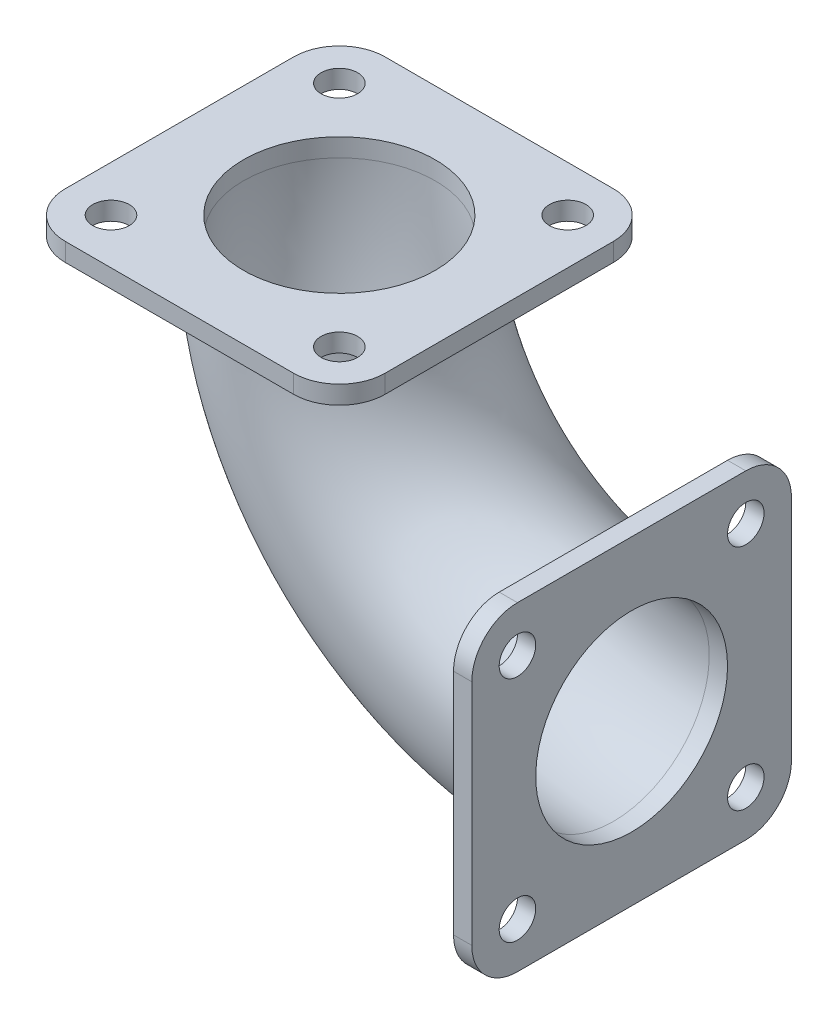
ISO-10303-21;
HEADER;
FILE_DESCRIPTION(('STEP AP214'),'2;1');
FILE_NAME('part.step','',(''),(''),'','','');
FILE_SCHEMA(('AUTOMOTIVE_DESIGN { 1 0 10303 214 1 1 1 1 }'));
ENDSEC;
DATA;
#1=APPLICATION_CONTEXT('core data for automotive mechanical design processes');
#2=APPLICATION_PROTOCOL_DEFINITION('international standard','automotive_design',2000,#1);
#3=PRODUCT_CONTEXT('',#1,'mechanical');
#4=PRODUCT('Part','Part','',(#3));
#5=PRODUCT_RELATED_PRODUCT_CATEGORY('part','',(#4));
#6=PRODUCT_DEFINITION_FORMATION('','',#4);
#7=PRODUCT_DEFINITION_CONTEXT('part definition',#1,'design');
#8=PRODUCT_DEFINITION('design','',#6,#7);
#9=PRODUCT_DEFINITION_SHAPE('','',#8);
#10=(LENGTH_UNIT() NAMED_UNIT(*) SI_UNIT(.MILLI.,.METRE.));
#11=(NAMED_UNIT(*) PLANE_ANGLE_UNIT() SI_UNIT($,.RADIAN.));
#12=(NAMED_UNIT(*) SI_UNIT($,.STERADIAN.) SOLID_ANGLE_UNIT());
#13=UNCERTAINTY_MEASURE_WITH_UNIT(LENGTH_MEASURE(1.E-05),#10,'distance_accuracy_value','');
#14=(GEOMETRIC_REPRESENTATION_CONTEXT(3) GLOBAL_UNCERTAINTY_ASSIGNED_CONTEXT((#13)) GLOBAL_UNIT_ASSIGNED_CONTEXT((#10,
#11,#12)) REPRESENTATION_CONTEXT('',''));
#15=CARTESIAN_POINT('',(0.,0.,0.));
#16=DIRECTION('',(0.,0.,1.));
#17=DIRECTION('',(1.,0.,0.));
#18=AXIS2_PLACEMENT_3D('',#15,#16,#17);
#19=CARTESIAN_POINT('',(0.,30.,0.));
#20=DIRECTION('',(0.,0.,1.));
#21=DIRECTION('',(1.,0.,0.));
#22=AXIS2_PLACEMENT_3D('',#19,#20,#21);
#23=TOROIDAL_SURFACE('',#22,30.,10.5);
#24=CARTESIAN_POINT('',(-30.,30.0000000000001,0.));
#25=DIRECTION('',(0.,-1.,0.));
#26=DIRECTION('',(0.,0.,-1.));
#27=AXIS2_PLACEMENT_3D('',#24,#25,#26);
#28=CIRCLE('',#27,10.5);
#29=CARTESIAN_POINT('',(-40.5,30.0000000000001,0.));
#30=VERTEX_POINT('',#29);
#31=EDGE_CURVE('E11',#30,#30,#28,.T.);
#32=CARTESIAN_POINT('',(0.,0.,0.));
#33=DIRECTION('',(1.,0.,0.));
#34=DIRECTION('',(0.,0.,-1.));
#35=AXIS2_PLACEMENT_3D('',#32,#33,#34);
#36=CIRCLE('',#35,10.5);
#37=CARTESIAN_POINT('',(0.,-10.5,0.));
#38=VERTEX_POINT('',#37);
#39=EDGE_CURVE('E282',#38,#38,#36,.T.);
#40=CARTESIAN_POINT('',(0.,30.,0.));
#41=DIRECTION('',(0.,0.,1.));
#42=DIRECTION('',(1.,0.,0.));
#43=AXIS2_PLACEMENT_3D('',#40,#41,#42);
#44=CIRCLE('',#43,40.5);
#45=EDGE_CURVE('',#30,#38,#44,.T.);
#46=ORIENTED_EDGE('',*,*,#31,.F.);
#47=ORIENTED_EDGE('',*,*,#39,.T.);
#48=ORIENTED_EDGE('',*,*,#45,.T.);
#49=ORIENTED_EDGE('',*,*,#45,.F.);
#50=EDGE_LOOP('',(#46,#48,#47,#49));
#51=FACE_BOUND('',#50,.T.);
#52=ADVANCED_FACE('F33',(#51),#23,.F.);
#53=CARTESIAN_POINT('',(0.,30.,0.));
#54=DIRECTION('',(0.,0.,1.));
#55=DIRECTION('',(1.,0.,0.));
#56=AXIS2_PLACEMENT_3D('',#53,#54,#55);
#57=TOROIDAL_SURFACE('',#56,30.,12.5);
#58=CARTESIAN_POINT('',(-30.,30.0000000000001,0.));
#59=DIRECTION('',(0.,1.,0.));
#60=DIRECTION('',(-1.,0.,0.));
#61=AXIS2_PLACEMENT_3D('',#58,#59,#60);
#62=CIRCLE('',#61,12.5);
#63=CARTESIAN_POINT('',(-42.5,30.0000000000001,0.));
#64=VERTEX_POINT('',#63);
#65=EDGE_CURVE('E165',#64,#64,#62,.F.);
#66=CARTESIAN_POINT('',(0.,0.,0.));
#67=DIRECTION('',(1.,0.,0.));
#68=DIRECTION('',(0.,0.,-1.));
#69=AXIS2_PLACEMENT_3D('',#66,#67,#68);
#70=CIRCLE('',#69,12.5);
#71=CARTESIAN_POINT('',(0.,-12.5,0.));
#72=VERTEX_POINT('',#71);
#73=EDGE_CURVE('E41',#72,#72,#70,.T.);
#74=CARTESIAN_POINT('',(0.,30.,0.));
#75=DIRECTION('',(0.,0.,1.));
#76=DIRECTION('',(1.,0.,0.));
#77=AXIS2_PLACEMENT_3D('',#74,#75,#76);
#78=CIRCLE('',#77,42.5);
#79=EDGE_CURVE('',#64,#72,#78,.T.);
#80=ORIENTED_EDGE('',*,*,#65,.T.);
#81=ORIENTED_EDGE('',*,*,#73,.F.);
#82=ORIENTED_EDGE('',*,*,#79,.T.);
#83=ORIENTED_EDGE('',*,*,#79,.F.);
#84=EDGE_LOOP('',(#80,#82,#81,#83));
#85=FACE_BOUND('',#84,.T.);
#86=ADVANCED_FACE('F35',(#85),#57,.T.);
#87=CARTESIAN_POINT('',(2.,12.5,12.5));
#88=DIRECTION('',(1.,0.,0.));
#89=DIRECTION('',(0.,0.,-1.));
#90=AXIS2_PLACEMENT_3D('',#87,#88,#89);
#91=PLANE('',#90);
#92=CARTESIAN_POINT('',(2.,12.5,-12.5));
#93=DIRECTION('',(1.,0.,0.));
#94=DIRECTION('',(0.,0.,-1.));
#95=AXIS2_PLACEMENT_3D('',#92,#93,#94);
#96=CIRCLE('',#95,2.);
#97=CARTESIAN_POINT('',(2.,12.5,-14.5));
#98=VERTEX_POINT('',#97);
#99=EDGE_CURVE('E567',#98,#98,#96,.T.);
#100=ORIENTED_EDGE('',*,*,#99,.F.);
#101=EDGE_LOOP('',(#100));
#102=FACE_BOUND('',#101,.T.);
#103=CARTESIAN_POINT('',(2.,-12.5,-12.5));
#104=DIRECTION('',(1.,0.,0.));
#105=DIRECTION('',(0.,0.,-1.));
#106=AXIS2_PLACEMENT_3D('',#103,#104,#105);
#107=CIRCLE('',#106,2.);
#108=CARTESIAN_POINT('',(2.,-12.5,-14.5));
#109=VERTEX_POINT('',#108);
#110=EDGE_CURVE('E573',#109,#109,#107,.T.);
#111=ORIENTED_EDGE('',*,*,#110,.F.);
#112=EDGE_LOOP('',(#111));
#113=FACE_BOUND('',#112,.T.);
#114=CARTESIAN_POINT('',(2.,12.5,12.5));
#115=DIRECTION('',(1.,0.,0.));
#116=DIRECTION('',(0.,0.,-1.));
#117=AXIS2_PLACEMENT_3D('',#114,#115,#116);
#118=CIRCLE('',#117,2.);
#119=CARTESIAN_POINT('',(2.,12.5,10.5));
#120=VERTEX_POINT('',#119);
#121=EDGE_CURVE('E579',#120,#120,#118,.T.);
#122=ORIENTED_EDGE('',*,*,#121,.F.);
#123=EDGE_LOOP('',(#122));
#124=FACE_BOUND('',#123,.T.);
#125=CARTESIAN_POINT('',(2.,-12.5,12.5));
#126=DIRECTION('',(1.,0.,0.));
#127=DIRECTION('',(0.,0.,-1.));
#128=AXIS2_PLACEMENT_3D('',#125,#126,#127);
#129=CIRCLE('',#128,2.);
#130=CARTESIAN_POINT('',(2.,-12.5,10.5));
#131=VERTEX_POINT('',#130);
#132=EDGE_CURVE('E585',#131,#131,#129,.T.);
#133=ORIENTED_EDGE('',*,*,#132,.F.);
#134=EDGE_LOOP('',(#133));
#135=FACE_BOUND('',#134,.T.);
#136=CARTESIAN_POINT('',(2.,12.5,12.5));
#137=DIRECTION('',(1.,0.,0.));
#138=DIRECTION('',(0.,0.,-1.));
#139=AXIS2_PLACEMENT_3D('',#136,#137,#138);
#140=CIRCLE('',#139,5.);
#141=CARTESIAN_POINT('',(2.,17.5,12.5));
#142=VERTEX_POINT('',#141);
#143=CARTESIAN_POINT('',(2.,12.5,17.5));
#144=VERTEX_POINT('',#143);
#145=EDGE_CURVE('E244',#142,#144,#140,.T.);
#146=ORIENTED_EDGE('',*,*,#145,.T.);
#147=DIRECTION('',(0.,-1.,0.));
#148=VECTOR('',#147,1.);
#149=CARTESIAN_POINT('',(2.,12.5,17.5));
#150=LINE('',#149,#148);
#151=CARTESIAN_POINT('',(2.,-12.5,17.5));
#152=VERTEX_POINT('',#151);
#153=EDGE_CURVE('E246',#144,#152,#150,.T.);
#154=ORIENTED_EDGE('',*,*,#153,.T.);
#155=CARTESIAN_POINT('',(2.,-12.5,12.5));
#156=DIRECTION('',(1.,0.,0.));
#157=DIRECTION('',(0.,0.,-1.));
#158=AXIS2_PLACEMENT_3D('',#155,#156,#157);
#159=CIRCLE('',#158,5.);
#160=CARTESIAN_POINT('',(2.,-17.5,12.5));
#161=VERTEX_POINT('',#160);
#162=EDGE_CURVE('E248',#152,#161,#159,.T.);
#163=ORIENTED_EDGE('',*,*,#162,.T.);
#164=DIRECTION('',(0.,0.,-1.));
#165=VECTOR('',#164,1.);
#166=CARTESIAN_POINT('',(2.,-17.5,12.5));
#167=LINE('',#166,#165);
#168=CARTESIAN_POINT('',(2.,-17.5,-12.5));
#169=VERTEX_POINT('',#168);
#170=EDGE_CURVE('E250',#161,#169,#167,.T.);
#171=ORIENTED_EDGE('',*,*,#170,.T.);
#172=CARTESIAN_POINT('',(2.,-12.5,-12.5));
#173=DIRECTION('',(1.,0.,0.));
#174=DIRECTION('',(0.,0.,-1.));
#175=AXIS2_PLACEMENT_3D('',#172,#173,#174);
#176=CIRCLE('',#175,5.);
#177=CARTESIAN_POINT('',(2.,-12.5,-17.5));
#178=VERTEX_POINT('',#177);
#179=EDGE_CURVE('E252',#169,#178,#176,.T.);
#180=ORIENTED_EDGE('',*,*,#179,.T.);
#181=DIRECTION('',(0.,1.,0.));
#182=VECTOR('',#181,1.);
#183=CARTESIAN_POINT('',(2.,12.5,-17.5));
#184=LINE('',#183,#182);
#185=CARTESIAN_POINT('',(2.,12.5,-17.5));
#186=VERTEX_POINT('',#185);
#187=EDGE_CURVE('E254',#178,#186,#184,.T.);
#188=ORIENTED_EDGE('',*,*,#187,.T.);
#189=CARTESIAN_POINT('',(2.,12.5,-12.5));
#190=DIRECTION('',(1.,0.,0.));
#191=DIRECTION('',(0.,0.,1.));
#192=AXIS2_PLACEMENT_3D('',#189,#190,#191);
#193=CIRCLE('',#192,5.);
#194=CARTESIAN_POINT('',(2.,17.5,-12.5));
#195=VERTEX_POINT('',#194);
#196=EDGE_CURVE('E53',#186,#195,#193,.T.);
#197=ORIENTED_EDGE('',*,*,#196,.T.);
#198=DIRECTION('',(0.,0.,1.));
#199=VECTOR('',#198,1.);
#200=CARTESIAN_POINT('',(2.,17.5,12.5));
#201=LINE('',#200,#199);
#202=EDGE_CURVE('E48',#195,#142,#201,.T.);
#203=ORIENTED_EDGE('',*,*,#202,.T.);
#204=EDGE_LOOP('',(#146,#154,#163,#171,#180,#188,#197,#203));
#205=FACE_BOUND('',#204,.T.);
#206=CARTESIAN_POINT('',(2.,0.,0.));
#207=DIRECTION('',(1.,0.,0.));
#208=DIRECTION('',(0.,0.,-1.));
#209=AXIS2_PLACEMENT_3D('',#206,#207,#208);
#210=CIRCLE('',#209,10.5);
#211=CARTESIAN_POINT('',(2.,0.,-10.5));
#212=VERTEX_POINT('',#211);
#213=EDGE_CURVE('E224',#212,#212,#210,.T.);
#214=ORIENTED_EDGE('',*,*,#213,.F.);
#215=EDGE_LOOP('',(#214));
#216=FACE_BOUND('',#215,.T.);
#217=ADVANCED_FACE('F291',(#102,#113,#124,#135,#205,#216),#91,.T.);
#218=CARTESIAN_POINT('',(0.,12.5,12.5));
#219=DIRECTION('',(1.,0.,0.));
#220=DIRECTION('',(0.,0.,-1.));
#221=AXIS2_PLACEMENT_3D('',#218,#219,#220);
#222=PLANE('',#221);
#223=CARTESIAN_POINT('',(0.,12.5,-12.5));
#224=DIRECTION('',(1.,0.,0.));
#225=DIRECTION('',(0.,0.,-1.));
#226=AXIS2_PLACEMENT_3D('',#223,#224,#225);
#227=CIRCLE('',#226,2.);
#228=CARTESIAN_POINT('',(0.,12.5,-14.5));
#229=VERTEX_POINT('',#228);
#230=EDGE_CURVE('E570',#229,#229,#227,.T.);
#231=ORIENTED_EDGE('',*,*,#230,.T.);
#232=EDGE_LOOP('',(#231));
#233=FACE_BOUND('',#232,.T.);
#234=CARTESIAN_POINT('',(0.,-12.5,-12.5));
#235=DIRECTION('',(1.,0.,0.));
#236=DIRECTION('',(0.,0.,-1.));
#237=AXIS2_PLACEMENT_3D('',#234,#235,#236);
#238=CIRCLE('',#237,2.);
#239=CARTESIAN_POINT('',(0.,-12.5,-14.5));
#240=VERTEX_POINT('',#239);
#241=EDGE_CURVE('E576',#240,#240,#238,.T.);
#242=ORIENTED_EDGE('',*,*,#241,.T.);
#243=EDGE_LOOP('',(#242));
#244=FACE_BOUND('',#243,.T.);
#245=CARTESIAN_POINT('',(0.,12.5,12.5));
#246=DIRECTION('',(1.,0.,0.));
#247=DIRECTION('',(0.,0.,-1.));
#248=AXIS2_PLACEMENT_3D('',#245,#246,#247);
#249=CIRCLE('',#248,2.);
#250=CARTESIAN_POINT('',(0.,12.5,10.5));
#251=VERTEX_POINT('',#250);
#252=EDGE_CURVE('E582',#251,#251,#249,.T.);
#253=ORIENTED_EDGE('',*,*,#252,.T.);
#254=EDGE_LOOP('',(#253));
#255=FACE_BOUND('',#254,.T.);
#256=CARTESIAN_POINT('',(0.,-12.5,12.5));
#257=DIRECTION('',(1.,0.,0.));
#258=DIRECTION('',(0.,0.,-1.));
#259=AXIS2_PLACEMENT_3D('',#256,#257,#258);
#260=CIRCLE('',#259,2.);
#261=CARTESIAN_POINT('',(0.,-12.5,10.5));
#262=VERTEX_POINT('',#261);
#263=EDGE_CURVE('E175',#262,#262,#260,.T.);
#264=ORIENTED_EDGE('',*,*,#263,.T.);
#265=EDGE_LOOP('',(#264));
#266=FACE_BOUND('',#265,.T.);
#267=ORIENTED_EDGE('',*,*,#73,.T.);
#268=EDGE_LOOP('',(#267));
#269=FACE_BOUND('',#268,.T.);
#270=CARTESIAN_POINT('',(0.,12.5,12.5));
#271=DIRECTION('',(1.,0.,0.));
#272=DIRECTION('',(0.,0.,-1.));
#273=AXIS2_PLACEMENT_3D('',#270,#271,#272);
#274=CIRCLE('',#273,5.);
#275=CARTESIAN_POINT('',(0.,17.5,12.5));
#276=VERTEX_POINT('',#275);
#277=CARTESIAN_POINT('',(0.,12.5,17.5));
#278=VERTEX_POINT('',#277);
#279=EDGE_CURVE('E227',#276,#278,#274,.T.);
#280=ORIENTED_EDGE('',*,*,#279,.F.);
#281=DIRECTION('',(0.,0.,1.));
#282=VECTOR('',#281,1.);
#283=CARTESIAN_POINT('',(0.,17.5,12.5));
#284=LINE('',#283,#282);
#285=CARTESIAN_POINT('',(0.,17.5,-12.5));
#286=VERTEX_POINT('',#285);
#287=EDGE_CURVE('E242',#286,#276,#284,.T.);
#288=ORIENTED_EDGE('',*,*,#287,.F.);
#289=CARTESIAN_POINT('',(0.,12.5,-12.5));
#290=DIRECTION('',(1.,0.,0.));
#291=DIRECTION('',(0.,0.,1.));
#292=AXIS2_PLACEMENT_3D('',#289,#290,#291);
#293=CIRCLE('',#292,5.);
#294=CARTESIAN_POINT('',(0.,12.5,-17.5));
#295=VERTEX_POINT('',#294);
#296=EDGE_CURVE('E240',#295,#286,#293,.T.);
#297=ORIENTED_EDGE('',*,*,#296,.F.);
#298=DIRECTION('',(0.,1.,0.));
#299=VECTOR('',#298,1.);
#300=CARTESIAN_POINT('',(0.,12.5,-17.5));
#301=LINE('',#300,#299);
#302=CARTESIAN_POINT('',(0.,-12.5,-17.5));
#303=VERTEX_POINT('',#302);
#304=EDGE_CURVE('E238',#303,#295,#301,.T.);
#305=ORIENTED_EDGE('',*,*,#304,.F.);
#306=CARTESIAN_POINT('',(0.,-12.5,-12.5));
#307=DIRECTION('',(1.,0.,0.));
#308=DIRECTION('',(0.,0.,-1.));
#309=AXIS2_PLACEMENT_3D('',#306,#307,#308);
#310=CIRCLE('',#309,5.);
#311=CARTESIAN_POINT('',(0.,-17.5,-12.5));
#312=VERTEX_POINT('',#311);
#313=EDGE_CURVE('E236',#312,#303,#310,.T.);
#314=ORIENTED_EDGE('',*,*,#313,.F.);
#315=DIRECTION('',(0.,0.,-1.));
#316=VECTOR('',#315,1.);
#317=CARTESIAN_POINT('',(0.,-17.5,12.5));
#318=LINE('',#317,#316);
#319=CARTESIAN_POINT('',(0.,-17.5,12.5));
#320=VERTEX_POINT('',#319);
#321=EDGE_CURVE('E234',#320,#312,#318,.T.);
#322=ORIENTED_EDGE('',*,*,#321,.F.);
#323=CARTESIAN_POINT('',(0.,-12.5,12.5));
#324=DIRECTION('',(1.,0.,0.));
#325=DIRECTION('',(0.,0.,-1.));
#326=AXIS2_PLACEMENT_3D('',#323,#324,#325);
#327=CIRCLE('',#326,5.);
#328=CARTESIAN_POINT('',(0.,-12.5,17.5));
#329=VERTEX_POINT('',#328);
#330=EDGE_CURVE('E232',#329,#320,#327,.T.);
#331=ORIENTED_EDGE('',*,*,#330,.F.);
#332=DIRECTION('',(0.,-1.,0.));
#333=VECTOR('',#332,1.);
#334=CARTESIAN_POINT('',(0.,12.5,17.5));
#335=LINE('',#334,#333);
#336=EDGE_CURVE('E230',#278,#329,#335,.T.);
#337=ORIENTED_EDGE('',*,*,#336,.F.);
#338=EDGE_LOOP('',(#280,#288,#297,#305,#314,#322,#331,#337));
#339=FACE_BOUND('',#338,.T.);
#340=ADVANCED_FACE('F287',(#233,#244,#255,#266,#269,#339),#222,.F.);
#341=CARTESIAN_POINT('',(2.,12.5,12.5));
#342=DIRECTION('',(-1.,0.,0.));
#343=DIRECTION('',(0.,0.,1.));
#344=AXIS2_PLACEMENT_3D('',#341,#342,#343);
#345=CYLINDRICAL_SURFACE('',#344,5.);
#346=ORIENTED_EDGE('',*,*,#279,.T.);
#347=DIRECTION('',(-1.,0.,0.));
#348=VECTOR('',#347,1.);
#349=CARTESIAN_POINT('',(2.,12.5,17.5));
#350=LINE('',#349,#348);
#351=EDGE_CURVE('E279',#144,#278,#350,.T.);
#352=ORIENTED_EDGE('',*,*,#351,.F.);
#353=ORIENTED_EDGE('',*,*,#145,.F.);
#354=DIRECTION('',(-1.,0.,0.));
#355=VECTOR('',#354,1.);
#356=CARTESIAN_POINT('',(2.,17.5,12.5));
#357=LINE('',#356,#355);
#358=EDGE_CURVE('E258',#142,#276,#357,.T.);
#359=ORIENTED_EDGE('',*,*,#358,.T.);
#360=EDGE_LOOP('',(#346,#352,#353,#359));
#361=FACE_BOUND('',#360,.T.);
#362=ADVANCED_FACE('F351',(#361),#345,.T.);
#363=CARTESIAN_POINT('',(2.,12.5,17.5));
#364=DIRECTION('',(0.,0.,-1.));
#365=DIRECTION('',(0.,1.,0.));
#366=AXIS2_PLACEMENT_3D('',#363,#364,#365);
#367=PLANE('',#366);
#368=ORIENTED_EDGE('',*,*,#336,.T.);
#369=DIRECTION('',(-1.,0.,0.));
#370=VECTOR('',#369,1.);
#371=CARTESIAN_POINT('',(2.,-12.5,17.5));
#372=LINE('',#371,#370);
#373=EDGE_CURVE('E276',#152,#329,#372,.T.);
#374=ORIENTED_EDGE('',*,*,#373,.F.);
#375=ORIENTED_EDGE('',*,*,#153,.F.);
#376=ORIENTED_EDGE('',*,*,#351,.T.);
#377=EDGE_LOOP('',(#368,#374,#375,#376));
#378=FACE_BOUND('',#377,.T.);
#379=ADVANCED_FACE('F376',(#378),#367,.F.);
#380=CARTESIAN_POINT('',(2.,-12.5,12.5));
#381=DIRECTION('',(-1.,0.,0.));
#382=DIRECTION('',(0.,0.,1.));
#383=AXIS2_PLACEMENT_3D('',#380,#381,#382);
#384=CYLINDRICAL_SURFACE('',#383,5.);
#385=ORIENTED_EDGE('',*,*,#330,.T.);
#386=DIRECTION('',(-1.,0.,0.));
#387=VECTOR('',#386,1.);
#388=CARTESIAN_POINT('',(2.,-17.5,12.5));
#389=LINE('',#388,#387);
#390=EDGE_CURVE('E273',#161,#320,#389,.T.);
#391=ORIENTED_EDGE('',*,*,#390,.F.);
#392=ORIENTED_EDGE('',*,*,#162,.F.);
#393=ORIENTED_EDGE('',*,*,#373,.T.);
#394=EDGE_LOOP('',(#385,#391,#392,#393));
#395=FACE_BOUND('',#394,.T.);
#396=ADVANCED_FACE('F372',(#395),#384,.T.);
#397=CARTESIAN_POINT('',(2.,-17.5,12.5));
#398=DIRECTION('',(0.,1.,0.));
#399=DIRECTION('',(0.,0.,1.));
#400=AXIS2_PLACEMENT_3D('',#397,#398,#399);
#401=PLANE('',#400);
#402=ORIENTED_EDGE('',*,*,#321,.T.);
#403=DIRECTION('',(-1.,0.,0.));
#404=VECTOR('',#403,1.);
#405=CARTESIAN_POINT('',(2.,-17.5,-12.5));
#406=LINE('',#405,#404);
#407=EDGE_CURVE('E270',#169,#312,#406,.T.);
#408=ORIENTED_EDGE('',*,*,#407,.F.);
#409=ORIENTED_EDGE('',*,*,#170,.F.);
#410=ORIENTED_EDGE('',*,*,#390,.T.);
#411=EDGE_LOOP('',(#402,#408,#409,#410));
#412=FACE_BOUND('',#411,.T.);
#413=ADVANCED_FACE('F368',(#412),#401,.F.);
#414=CARTESIAN_POINT('',(2.,-12.5,-12.5));
#415=DIRECTION('',(-1.,0.,0.));
#416=DIRECTION('',(0.,0.,1.));
#417=AXIS2_PLACEMENT_3D('',#414,#415,#416);
#418=CYLINDRICAL_SURFACE('',#417,5.);
#419=ORIENTED_EDGE('',*,*,#313,.T.);
#420=DIRECTION('',(-1.,0.,0.));
#421=VECTOR('',#420,1.);
#422=CARTESIAN_POINT('',(2.,-12.5,-17.5));
#423=LINE('',#422,#421);
#424=EDGE_CURVE('E267',#178,#303,#423,.T.);
#425=ORIENTED_EDGE('',*,*,#424,.F.);
#426=ORIENTED_EDGE('',*,*,#179,.F.);
#427=ORIENTED_EDGE('',*,*,#407,.T.);
#428=EDGE_LOOP('',(#419,#425,#426,#427));
#429=FACE_BOUND('',#428,.T.);
#430=ADVANCED_FACE('F364',(#429),#418,.T.);
#431=CARTESIAN_POINT('',(2.,12.5,-17.5));
#432=DIRECTION('',(0.,0.,1.));
#433=DIRECTION('',(0.,-1.,0.));
#434=AXIS2_PLACEMENT_3D('',#431,#432,#433);
#435=PLANE('',#434);
#436=ORIENTED_EDGE('',*,*,#304,.T.);
#437=DIRECTION('',(-1.,0.,0.));
#438=VECTOR('',#437,1.);
#439=CARTESIAN_POINT('',(2.,12.5,-17.5));
#440=LINE('',#439,#438);
#441=EDGE_CURVE('E264',#186,#295,#440,.T.);
#442=ORIENTED_EDGE('',*,*,#441,.F.);
#443=ORIENTED_EDGE('',*,*,#187,.F.);
#444=ORIENTED_EDGE('',*,*,#424,.T.);
#445=EDGE_LOOP('',(#436,#442,#443,#444));
#446=FACE_BOUND('',#445,.T.);
#447=ADVANCED_FACE('F360',(#446),#435,.F.);
#448=CARTESIAN_POINT('',(2.,12.5,-12.5));
#449=DIRECTION('',(-1.,0.,0.));
#450=DIRECTION('',(0.,0.,1.));
#451=AXIS2_PLACEMENT_3D('',#448,#449,#450);
#452=CYLINDRICAL_SURFACE('',#451,5.);
#453=ORIENTED_EDGE('',*,*,#296,.T.);
#454=DIRECTION('',(-1.,0.,0.));
#455=VECTOR('',#454,1.);
#456=CARTESIAN_POINT('',(2.,17.5,-12.5));
#457=LINE('',#456,#455);
#458=EDGE_CURVE('E261',#195,#286,#457,.T.);
#459=ORIENTED_EDGE('',*,*,#458,.F.);
#460=ORIENTED_EDGE('',*,*,#196,.F.);
#461=ORIENTED_EDGE('',*,*,#441,.T.);
#462=EDGE_LOOP('',(#453,#459,#460,#461));
#463=FACE_BOUND('',#462,.T.);
#464=ADVANCED_FACE('F356',(#463),#452,.T.);
#465=CARTESIAN_POINT('',(2.,17.5,12.5));
#466=DIRECTION('',(0.,-1.,0.));
#467=DIRECTION('',(0.,0.,-1.));
#468=AXIS2_PLACEMENT_3D('',#465,#466,#467);
#469=PLANE('',#468);
#470=ORIENTED_EDGE('',*,*,#287,.T.);
#471=ORIENTED_EDGE('',*,*,#358,.F.);
#472=ORIENTED_EDGE('',*,*,#202,.F.);
#473=ORIENTED_EDGE('',*,*,#458,.T.);
#474=EDGE_LOOP('',(#470,#471,#472,#473));
#475=FACE_BOUND('',#474,.T.);
#476=ADVANCED_FACE('F348',(#475),#469,.F.);
#477=CARTESIAN_POINT('',(2.,0.,0.));
#478=DIRECTION('',(-1.,0.,0.));
#479=DIRECTION('',(0.,0.,1.));
#480=AXIS2_PLACEMENT_3D('',#477,#478,#479);
#481=CYLINDRICAL_SURFACE('',#480,10.5);
#482=ORIENTED_EDGE('',*,*,#213,.T.);
#483=EDGE_LOOP('',(#482));
#484=FACE_BOUND('',#483,.T.);
#485=ORIENTED_EDGE('',*,*,#39,.F.);
#486=EDGE_LOOP('',(#485));
#487=FACE_BOUND('',#486,.T.);
#488=ADVANCED_FACE('F311',(#484,#487),#481,.F.);
#489=CARTESIAN_POINT('',(-17.5,31.9999999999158,12.5));
#490=DIRECTION('',(0.,1.,0.));
#491=DIRECTION('',(-1.,0.,0.));
#492=AXIS2_PLACEMENT_3D('',#489,#490,#491);
#493=PLANE('',#492);
#494=CARTESIAN_POINT('',(-17.5,31.9999999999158,12.5));
#495=DIRECTION('',(0.,1.,0.));
#496=DIRECTION('',(0.,0.,1.));
#497=AXIS2_PLACEMENT_3D('',#494,#495,#496);
#498=CIRCLE('',#497,2.);
#499=CARTESIAN_POINT('',(-17.5,31.9999999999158,14.5));
#500=VERTEX_POINT('',#499);
#501=EDGE_CURVE('E545',#500,#500,#498,.T.);
#502=ORIENTED_EDGE('',*,*,#501,.F.);
#503=EDGE_LOOP('',(#502));
#504=FACE_BOUND('',#503,.T.);
#505=CARTESIAN_POINT('',(-17.5,31.9999999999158,-12.5));
#506=DIRECTION('',(0.,1.,0.));
#507=DIRECTION('',(0.,0.,1.));
#508=AXIS2_PLACEMENT_3D('',#505,#506,#507);
#509=CIRCLE('',#508,2.);
#510=CARTESIAN_POINT('',(-17.5,31.9999999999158,-10.5));
#511=VERTEX_POINT('',#510);
#512=EDGE_CURVE('E547',#511,#511,#509,.T.);
#513=ORIENTED_EDGE('',*,*,#512,.F.);
#514=EDGE_LOOP('',(#513));
#515=FACE_BOUND('',#514,.T.);
#516=CARTESIAN_POINT('',(-42.5,31.9999999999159,-12.5));
#517=DIRECTION('',(0.,1.,0.));
#518=DIRECTION('',(0.,0.,1.));
#519=AXIS2_PLACEMENT_3D('',#516,#517,#518);
#520=CIRCLE('',#519,2.);
#521=CARTESIAN_POINT('',(-42.5,31.9999999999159,-10.5));
#522=VERTEX_POINT('',#521);
#523=EDGE_CURVE('E555',#522,#522,#520,.T.);
#524=ORIENTED_EDGE('',*,*,#523,.F.);
#525=EDGE_LOOP('',(#524));
#526=FACE_BOUND('',#525,.T.);
#527=CARTESIAN_POINT('',(-42.5,31.9999999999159,12.5));
#528=DIRECTION('',(0.,1.,0.));
#529=DIRECTION('',(0.,0.,1.));
#530=AXIS2_PLACEMENT_3D('',#527,#528,#529);
#531=CIRCLE('',#530,2.);
#532=CARTESIAN_POINT('',(-42.5,31.9999999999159,14.5));
#533=VERTEX_POINT('',#532);
#534=EDGE_CURVE('E561',#533,#533,#531,.T.);
#535=ORIENTED_EDGE('',*,*,#534,.F.);
#536=EDGE_LOOP('',(#535));
#537=FACE_BOUND('',#536,.T.);
#538=CARTESIAN_POINT('',(-17.5,31.9999999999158,12.5));
#539=DIRECTION('',(0.,1.,0.));
#540=DIRECTION('',(-1.,0.,0.));
#541=AXIS2_PLACEMENT_3D('',#538,#539,#540);
#542=CIRCLE('',#541,5.);
#543=CARTESIAN_POINT('',(-17.5,31.9999999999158,17.5));
#544=VERTEX_POINT('',#543);
#545=CARTESIAN_POINT('',(-12.5,31.9999999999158,12.5));
#546=VERTEX_POINT('',#545);
#547=EDGE_CURVE('E190',#544,#546,#542,.T.);
#548=ORIENTED_EDGE('',*,*,#547,.T.);
#549=DIRECTION('',(0.,0.,-1.));
#550=VECTOR('',#549,1.);
#551=CARTESIAN_POINT('',(-12.5,31.9999999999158,12.5));
#552=LINE('',#551,#550);
#553=CARTESIAN_POINT('',(-12.5,31.9999999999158,-12.5));
#554=VERTEX_POINT('',#553);
#555=EDGE_CURVE('E161',#546,#554,#552,.T.);
#556=ORIENTED_EDGE('',*,*,#555,.T.);
#557=CARTESIAN_POINT('',(-17.5,31.9999999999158,-12.5));
#558=DIRECTION('',(0.,1.,0.));
#559=DIRECTION('',(-1.,0.,0.));
#560=AXIS2_PLACEMENT_3D('',#557,#558,#559);
#561=CIRCLE('',#560,5.);
#562=CARTESIAN_POINT('',(-17.5,31.9999999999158,-17.5));
#563=VERTEX_POINT('',#562);
#564=EDGE_CURVE('E193',#554,#563,#561,.T.);
#565=ORIENTED_EDGE('',*,*,#564,.T.);
#566=DIRECTION('',(-1.,0.,0.));
#567=VECTOR('',#566,1.);
#568=CARTESIAN_POINT('',(-17.5,31.9999999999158,-17.5));
#569=LINE('',#568,#567);
#570=CARTESIAN_POINT('',(-42.5,31.9999999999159,-17.5));
#571=VERTEX_POINT('',#570);
#572=EDGE_CURVE('E195',#563,#571,#569,.T.);
#573=ORIENTED_EDGE('',*,*,#572,.T.);
#574=CARTESIAN_POINT('',(-42.5,31.9999999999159,-12.5));
#575=DIRECTION('',(0.,1.,0.));
#576=DIRECTION('',(-1.,0.,0.));
#577=AXIS2_PLACEMENT_3D('',#574,#575,#576);
#578=CIRCLE('',#577,5.);
#579=CARTESIAN_POINT('',(-47.5,31.9999999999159,-12.5));
#580=VERTEX_POINT('',#579);
#581=EDGE_CURVE('E197',#571,#580,#578,.T.);
#582=ORIENTED_EDGE('',*,*,#581,.T.);
#583=DIRECTION('',(0.,0.,1.));
#584=VECTOR('',#583,1.);
#585=CARTESIAN_POINT('',(-47.5,31.9999999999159,12.5));
#586=LINE('',#585,#584);
#587=CARTESIAN_POINT('',(-47.5,31.9999999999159,12.5));
#588=VERTEX_POINT('',#587);
#589=EDGE_CURVE('E199',#580,#588,#586,.T.);
#590=ORIENTED_EDGE('',*,*,#589,.T.);
#591=CARTESIAN_POINT('',(-42.5,31.9999999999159,12.5));
#592=DIRECTION('',(0.,1.,0.));
#593=DIRECTION('',(1.,0.,0.));
#594=AXIS2_PLACEMENT_3D('',#591,#592,#593);
#595=CIRCLE('',#594,5.);
#596=CARTESIAN_POINT('',(-42.5,31.9999999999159,17.5));
#597=VERTEX_POINT('',#596);
#598=EDGE_CURVE('E201',#588,#597,#595,.T.);
#599=ORIENTED_EDGE('',*,*,#598,.T.);
#600=DIRECTION('',(1.,0.,0.));
#601=VECTOR('',#600,1.);
#602=CARTESIAN_POINT('',(-17.5,31.9999999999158,17.5));
#603=LINE('',#602,#601);
#604=EDGE_CURVE('E203',#597,#544,#603,.T.);
#605=ORIENTED_EDGE('',*,*,#604,.T.);
#606=EDGE_LOOP('',(#548,#556,#565,#573,#582,#590,#599,#605));
#607=FACE_BOUND('',#606,.T.);
#608=CARTESIAN_POINT('',(-30.,31.9999999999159,0.));
#609=DIRECTION('',(0.,1.,0.));
#610=DIRECTION('',(-1.,0.,0.));
#611=AXIS2_PLACEMENT_3D('',#608,#609,#610);
#612=CIRCLE('',#611,10.5);
#613=CARTESIAN_POINT('',(-40.5,31.9999999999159,0.));
#614=VERTEX_POINT('',#613);
#615=EDGE_CURVE('E172',#614,#614,#612,.T.);
#616=ORIENTED_EDGE('',*,*,#615,.F.);
#617=EDGE_LOOP('',(#616));
#618=FACE_BOUND('',#617,.T.);
#619=ADVANCED_FACE('F303',(#504,#515,#526,#537,#607,#618),#493,.T.);
#620=CARTESIAN_POINT('',(-17.5,29.9999999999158,12.5));
#621=DIRECTION('',(0.,1.,0.));
#622=DIRECTION('',(-1.,0.,0.));
#623=AXIS2_PLACEMENT_3D('',#620,#621,#622);
#624=PLANE('',#623);
#625=CARTESIAN_POINT('',(-17.5,29.9999999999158,12.5));
#626=DIRECTION('',(0.,1.,0.));
#627=DIRECTION('',(-1.,0.,0.));
#628=AXIS2_PLACEMENT_3D('',#625,#626,#627);
#629=CIRCLE('',#628,2.);
#630=CARTESIAN_POINT('',(-19.5,29.9999999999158,12.5));
#631=VERTEX_POINT('',#630);
#632=EDGE_CURVE('E542',#631,#631,#629,.T.);
#633=ORIENTED_EDGE('',*,*,#632,.T.);
#634=EDGE_LOOP('',(#633));
#635=FACE_BOUND('',#634,.T.);
#636=CARTESIAN_POINT('',(-17.5,29.9999999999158,-12.5));
#637=DIRECTION('',(0.,1.,0.));
#638=DIRECTION('',(-1.,0.,0.));
#639=AXIS2_PLACEMENT_3D('',#636,#637,#638);
#640=CIRCLE('',#639,2.);
#641=CARTESIAN_POINT('',(-19.5,29.9999999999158,-12.5));
#642=VERTEX_POINT('',#641);
#643=EDGE_CURVE('E552',#642,#642,#640,.T.);
#644=ORIENTED_EDGE('',*,*,#643,.T.);
#645=EDGE_LOOP('',(#644));
#646=FACE_BOUND('',#645,.T.);
#647=CARTESIAN_POINT('',(-42.5,29.9999999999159,-12.5));
#648=DIRECTION('',(0.,1.,0.));
#649=DIRECTION('',(-1.,0.,0.));
#650=AXIS2_PLACEMENT_3D('',#647,#648,#649);
#651=CIRCLE('',#650,2.);
#652=CARTESIAN_POINT('',(-44.5,29.9999999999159,-12.5));
#653=VERTEX_POINT('',#652);
#654=EDGE_CURVE('E558',#653,#653,#651,.T.);
#655=ORIENTED_EDGE('',*,*,#654,.T.);
#656=EDGE_LOOP('',(#655));
#657=FACE_BOUND('',#656,.T.);
#658=CARTESIAN_POINT('',(-42.5,29.9999999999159,12.5));
#659=DIRECTION('',(0.,1.,0.));
#660=DIRECTION('',(-1.,0.,0.));
#661=AXIS2_PLACEMENT_3D('',#658,#659,#660);
#662=CIRCLE('',#661,2.);
#663=CARTESIAN_POINT('',(-44.5,29.9999999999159,12.5));
#664=VERTEX_POINT('',#663);
#665=EDGE_CURVE('E564',#664,#664,#662,.T.);
#666=ORIENTED_EDGE('',*,*,#665,.T.);
#667=EDGE_LOOP('',(#666));
#668=FACE_BOUND('',#667,.T.);
#669=ORIENTED_EDGE('',*,*,#65,.F.);
#670=EDGE_LOOP('',(#669));
#671=FACE_BOUND('',#670,.T.);
#672=CARTESIAN_POINT('',(-17.5,29.9999999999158,12.5));
#673=DIRECTION('',(0.,1.,0.));
#674=DIRECTION('',(-1.,0.,0.));
#675=AXIS2_PLACEMENT_3D('',#672,#673,#674);
#676=CIRCLE('',#675,5.);
#677=CARTESIAN_POINT('',(-17.5,29.9999999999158,17.5));
#678=VERTEX_POINT('',#677);
#679=CARTESIAN_POINT('',(-12.5,29.9999999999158,12.5));
#680=VERTEX_POINT('',#679);
#681=EDGE_CURVE('E151',#678,#680,#676,.T.);
#682=ORIENTED_EDGE('',*,*,#681,.F.);
#683=DIRECTION('',(1.,0.,0.));
#684=VECTOR('',#683,1.);
#685=CARTESIAN_POINT('',(-17.5,29.9999999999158,17.5));
#686=LINE('',#685,#684);
#687=CARTESIAN_POINT('',(-42.5,29.9999999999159,17.5));
#688=VERTEX_POINT('',#687);
#689=EDGE_CURVE('E188',#688,#678,#686,.T.);
#690=ORIENTED_EDGE('',*,*,#689,.F.);
#691=CARTESIAN_POINT('',(-42.5,29.9999999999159,12.5));
#692=DIRECTION('',(0.,1.,0.));
#693=DIRECTION('',(1.,0.,0.));
#694=AXIS2_PLACEMENT_3D('',#691,#692,#693);
#695=CIRCLE('',#694,5.);
#696=CARTESIAN_POINT('',(-47.5,29.9999999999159,12.5));
#697=VERTEX_POINT('',#696);
#698=EDGE_CURVE('E186',#697,#688,#695,.T.);
#699=ORIENTED_EDGE('',*,*,#698,.F.);
#700=DIRECTION('',(0.,0.,1.));
#701=VECTOR('',#700,1.);
#702=CARTESIAN_POINT('',(-47.5,29.9999999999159,12.5));
#703=LINE('',#702,#701);
#704=CARTESIAN_POINT('',(-47.5,29.9999999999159,-12.5));
#705=VERTEX_POINT('',#704);
#706=EDGE_CURVE('E184',#705,#697,#703,.T.);
#707=ORIENTED_EDGE('',*,*,#706,.F.);
#708=CARTESIAN_POINT('',(-42.5,29.9999999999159,-12.5));
#709=DIRECTION('',(0.,1.,0.));
#710=DIRECTION('',(-1.,0.,0.));
#711=AXIS2_PLACEMENT_3D('',#708,#709,#710);
#712=CIRCLE('',#711,5.);
#713=CARTESIAN_POINT('',(-42.5,29.9999999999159,-17.5));
#714=VERTEX_POINT('',#713);
#715=EDGE_CURVE('E182',#714,#705,#712,.T.);
#716=ORIENTED_EDGE('',*,*,#715,.F.);
#717=DIRECTION('',(-1.,0.,0.));
#718=VECTOR('',#717,1.);
#719=CARTESIAN_POINT('',(-17.5,29.9999999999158,-17.5));
#720=LINE('',#719,#718);
#721=CARTESIAN_POINT('',(-17.5,29.9999999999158,-17.5));
#722=VERTEX_POINT('',#721);
#723=EDGE_CURVE('E180',#722,#714,#720,.T.);
#724=ORIENTED_EDGE('',*,*,#723,.F.);
#725=CARTESIAN_POINT('',(-17.5,29.9999999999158,-12.5));
#726=DIRECTION('',(0.,1.,0.));
#727=DIRECTION('',(-1.,0.,0.));
#728=AXIS2_PLACEMENT_3D('',#725,#726,#727);
#729=CIRCLE('',#728,5.);
#730=CARTESIAN_POINT('',(-12.5,29.9999999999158,-12.5));
#731=VERTEX_POINT('',#730);
#732=EDGE_CURVE('E153',#731,#722,#729,.T.);
#733=ORIENTED_EDGE('',*,*,#732,.F.);
#734=DIRECTION('',(0.,0.,-1.));
#735=VECTOR('',#734,1.);
#736=CARTESIAN_POINT('',(-12.5,29.9999999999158,12.5));
#737=LINE('',#736,#735);
#738=EDGE_CURVE('E146',#680,#731,#737,.T.);
#739=ORIENTED_EDGE('',*,*,#738,.F.);
#740=EDGE_LOOP('',(#682,#690,#699,#707,#716,#724,#733,#739));
#741=FACE_BOUND('',#740,.T.);
#742=ADVANCED_FACE('F148',(#635,#646,#657,#668,#671,#741),#624,.F.);
#743=CARTESIAN_POINT('',(-17.5,31.9999999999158,12.5));
#744=DIRECTION('',(0.,-1.,0.));
#745=DIRECTION('',(1.,0.,0.));
#746=AXIS2_PLACEMENT_3D('',#743,#744,#745);
#747=CYLINDRICAL_SURFACE('',#746,5.);
#748=ORIENTED_EDGE('',*,*,#681,.T.);
#749=DIRECTION('',(0.,-1.,0.));
#750=VECTOR('',#749,1.);
#751=CARTESIAN_POINT('',(-12.5,31.9999999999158,12.5));
#752=LINE('',#751,#750);
#753=EDGE_CURVE('E159',#546,#680,#752,.T.);
#754=ORIENTED_EDGE('',*,*,#753,.F.);
#755=ORIENTED_EDGE('',*,*,#547,.F.);
#756=DIRECTION('',(0.,-1.,0.));
#757=VECTOR('',#756,1.);
#758=CARTESIAN_POINT('',(-17.5,31.9999999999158,17.5));
#759=LINE('',#758,#757);
#760=EDGE_CURVE('E171',#544,#678,#759,.T.);
#761=ORIENTED_EDGE('',*,*,#760,.T.);
#762=EDGE_LOOP('',(#748,#754,#755,#761));
#763=FACE_BOUND('',#762,.T.);
#764=ADVANCED_FACE('F169',(#763),#747,.T.);
#765=CARTESIAN_POINT('',(-12.5,31.9999999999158,12.5));
#766=DIRECTION('',(-1.,0.,0.));
#767=DIRECTION('',(0.,-1.,0.));
#768=AXIS2_PLACEMENT_3D('',#765,#766,#767);
#769=PLANE('',#768);
#770=ORIENTED_EDGE('',*,*,#738,.T.);
#771=DIRECTION('',(0.,-1.,0.));
#772=VECTOR('',#771,1.);
#773=CARTESIAN_POINT('',(-12.5,31.9999999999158,-12.5));
#774=LINE('',#773,#772);
#775=EDGE_CURVE('E166',#554,#731,#774,.T.);
#776=ORIENTED_EDGE('',*,*,#775,.F.);
#777=ORIENTED_EDGE('',*,*,#555,.F.);
#778=ORIENTED_EDGE('',*,*,#753,.T.);
#779=EDGE_LOOP('',(#770,#776,#777,#778));
#780=FACE_BOUND('',#779,.T.);
#781=ADVANCED_FACE('F160',(#780),#769,.F.);
#782=CARTESIAN_POINT('',(-17.5,31.9999999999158,-12.5));
#783=DIRECTION('',(0.,-1.,0.));
#784=DIRECTION('',(1.,0.,0.));
#785=AXIS2_PLACEMENT_3D('',#782,#783,#784);
#786=CYLINDRICAL_SURFACE('',#785,5.);
#787=ORIENTED_EDGE('',*,*,#732,.T.);
#788=DIRECTION('',(0.,-1.,0.));
#789=VECTOR('',#788,1.);
#790=CARTESIAN_POINT('',(-17.5,31.9999999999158,-17.5));
#791=LINE('',#790,#789);
#792=EDGE_CURVE('E218',#563,#722,#791,.T.);
#793=ORIENTED_EDGE('',*,*,#792,.F.);
#794=ORIENTED_EDGE('',*,*,#564,.F.);
#795=ORIENTED_EDGE('',*,*,#775,.T.);
#796=EDGE_LOOP('',(#787,#793,#794,#795));
#797=FACE_BOUND('',#796,.T.);
#798=ADVANCED_FACE('F339',(#797),#786,.T.);
#799=CARTESIAN_POINT('',(-17.5,31.9999999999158,-17.5));
#800=DIRECTION('',(0.,0.,1.));
#801=DIRECTION('',(1.,0.,0.));
#802=AXIS2_PLACEMENT_3D('',#799,#800,#801);
#803=PLANE('',#802);
#804=ORIENTED_EDGE('',*,*,#723,.T.);
#805=DIRECTION('',(0.,-1.,0.));
#806=VECTOR('',#805,1.);
#807=CARTESIAN_POINT('',(-42.5,31.9999999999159,-17.5));
#808=LINE('',#807,#806);
#809=EDGE_CURVE('E215',#571,#714,#808,.T.);
#810=ORIENTED_EDGE('',*,*,#809,.F.);
#811=ORIENTED_EDGE('',*,*,#572,.F.);
#812=ORIENTED_EDGE('',*,*,#792,.T.);
#813=EDGE_LOOP('',(#804,#810,#811,#812));
#814=FACE_BOUND('',#813,.T.);
#815=ADVANCED_FACE('F335',(#814),#803,.F.);
#816=CARTESIAN_POINT('',(-42.5,31.9999999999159,-12.5));
#817=DIRECTION('',(0.,-1.,0.));
#818=DIRECTION('',(1.,0.,0.));
#819=AXIS2_PLACEMENT_3D('',#816,#817,#818);
#820=CYLINDRICAL_SURFACE('',#819,5.);
#821=ORIENTED_EDGE('',*,*,#715,.T.);
#822=DIRECTION('',(0.,-1.,0.));
#823=VECTOR('',#822,1.);
#824=CARTESIAN_POINT('',(-47.5,31.9999999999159,-12.5));
#825=LINE('',#824,#823);
#826=EDGE_CURVE('E212',#580,#705,#825,.T.);
#827=ORIENTED_EDGE('',*,*,#826,.F.);
#828=ORIENTED_EDGE('',*,*,#581,.F.);
#829=ORIENTED_EDGE('',*,*,#809,.T.);
#830=EDGE_LOOP('',(#821,#827,#828,#829));
#831=FACE_BOUND('',#830,.T.);
#832=ADVANCED_FACE('F331',(#831),#820,.T.);
#833=CARTESIAN_POINT('',(-47.5,31.9999999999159,12.5));
#834=DIRECTION('',(1.,0.,0.));
#835=DIRECTION('',(0.,1.,0.));
#836=AXIS2_PLACEMENT_3D('',#833,#834,#835);
#837=PLANE('',#836);
#838=ORIENTED_EDGE('',*,*,#706,.T.);
#839=DIRECTION('',(0.,-1.,0.));
#840=VECTOR('',#839,1.);
#841=CARTESIAN_POINT('',(-47.5,31.9999999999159,12.5));
#842=LINE('',#841,#840);
#843=EDGE_CURVE('E209',#588,#697,#842,.T.);
#844=ORIENTED_EDGE('',*,*,#843,.F.);
#845=ORIENTED_EDGE('',*,*,#589,.F.);
#846=ORIENTED_EDGE('',*,*,#826,.T.);
#847=EDGE_LOOP('',(#838,#844,#845,#846));
#848=FACE_BOUND('',#847,.T.);
#849=ADVANCED_FACE('F327',(#848),#837,.F.);
#850=CARTESIAN_POINT('',(-42.5,31.9999999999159,12.5));
#851=DIRECTION('',(0.,-1.,0.));
#852=DIRECTION('',(1.,0.,0.));
#853=AXIS2_PLACEMENT_3D('',#850,#851,#852);
#854=CYLINDRICAL_SURFACE('',#853,5.);
#855=ORIENTED_EDGE('',*,*,#698,.T.);
#856=DIRECTION('',(0.,-1.,0.));
#857=VECTOR('',#856,1.);
#858=CARTESIAN_POINT('',(-42.5,31.9999999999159,17.5));
#859=LINE('',#858,#857);
#860=EDGE_CURVE('E206',#597,#688,#859,.T.);
#861=ORIENTED_EDGE('',*,*,#860,.F.);
#862=ORIENTED_EDGE('',*,*,#598,.F.);
#863=ORIENTED_EDGE('',*,*,#843,.T.);
#864=EDGE_LOOP('',(#855,#861,#862,#863));
#865=FACE_BOUND('',#864,.T.);
#866=ADVANCED_FACE('F323',(#865),#854,.T.);
#867=CARTESIAN_POINT('',(-17.5,31.9999999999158,17.5));
#868=DIRECTION('',(0.,0.,-1.));
#869=DIRECTION('',(-1.,0.,0.));
#870=AXIS2_PLACEMENT_3D('',#867,#868,#869);
#871=PLANE('',#870);
#872=ORIENTED_EDGE('',*,*,#689,.T.);
#873=ORIENTED_EDGE('',*,*,#760,.F.);
#874=ORIENTED_EDGE('',*,*,#604,.F.);
#875=ORIENTED_EDGE('',*,*,#860,.T.);
#876=EDGE_LOOP('',(#872,#873,#874,#875));
#877=FACE_BOUND('',#876,.T.);
#878=ADVANCED_FACE('F320',(#877),#871,.F.);
#879=CARTESIAN_POINT('',(-30.,31.9999999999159,0.));
#880=DIRECTION('',(0.,-1.,0.));
#881=DIRECTION('',(1.,0.,0.));
#882=AXIS2_PLACEMENT_3D('',#879,#880,#881);
#883=CYLINDRICAL_SURFACE('',#882,10.5);
#884=ORIENTED_EDGE('',*,*,#615,.T.);
#885=EDGE_LOOP('',(#884));
#886=FACE_BOUND('',#885,.T.);
#887=ORIENTED_EDGE('',*,*,#31,.T.);
#888=EDGE_LOOP('',(#887));
#889=FACE_BOUND('',#888,.T.);
#890=ADVANCED_FACE('F317',(#886,#889),#883,.F.);
#891=CARTESIAN_POINT('',(2.,-12.5,12.5));
#892=DIRECTION('',(1.,0.,0.));
#893=DIRECTION('',(0.,0.,-1.));
#894=AXIS2_PLACEMENT_3D('',#891,#892,#893);
#895=CYLINDRICAL_SURFACE('',#894,2.);
#896=ORIENTED_EDGE('',*,*,#263,.F.);
#897=EDGE_LOOP('',(#896));
#898=FACE_BOUND('',#897,.T.);
#899=ORIENTED_EDGE('',*,*,#132,.T.);
#900=EDGE_LOOP('',(#899));
#901=FACE_BOUND('',#900,.T.);
#902=ADVANCED_FACE('F460',(#898,#901),#895,.F.);
#903=CARTESIAN_POINT('',(2.,12.5,12.5));
#904=DIRECTION('',(1.,0.,0.));
#905=DIRECTION('',(0.,0.,-1.));
#906=AXIS2_PLACEMENT_3D('',#903,#904,#905);
#907=CYLINDRICAL_SURFACE('',#906,2.);
#908=ORIENTED_EDGE('',*,*,#252,.F.);
#909=EDGE_LOOP('',(#908));
#910=FACE_BOUND('',#909,.T.);
#911=ORIENTED_EDGE('',*,*,#121,.T.);
#912=EDGE_LOOP('',(#911));
#913=FACE_BOUND('',#912,.T.);
#914=ADVANCED_FACE('F465',(#910,#913),#907,.F.);
#915=CARTESIAN_POINT('',(2.,-12.5,-12.5));
#916=DIRECTION('',(1.,0.,0.));
#917=DIRECTION('',(0.,0.,-1.));
#918=AXIS2_PLACEMENT_3D('',#915,#916,#917);
#919=CYLINDRICAL_SURFACE('',#918,2.);
#920=ORIENTED_EDGE('',*,*,#241,.F.);
#921=EDGE_LOOP('',(#920));
#922=FACE_BOUND('',#921,.T.);
#923=ORIENTED_EDGE('',*,*,#110,.T.);
#924=EDGE_LOOP('',(#923));
#925=FACE_BOUND('',#924,.T.);
#926=ADVANCED_FACE('F476',(#922,#925),#919,.F.);
#927=CARTESIAN_POINT('',(2.,12.5,-12.5));
#928=DIRECTION('',(1.,0.,0.));
#929=DIRECTION('',(0.,0.,-1.));
#930=AXIS2_PLACEMENT_3D('',#927,#928,#929);
#931=CYLINDRICAL_SURFACE('',#930,2.);
#932=ORIENTED_EDGE('',*,*,#230,.F.);
#933=EDGE_LOOP('',(#932));
#934=FACE_BOUND('',#933,.T.);
#935=ORIENTED_EDGE('',*,*,#99,.T.);
#936=EDGE_LOOP('',(#935));
#937=FACE_BOUND('',#936,.T.);
#938=ADVANCED_FACE('F486',(#934,#937),#931,.F.);
#939=CARTESIAN_POINT('',(-42.5,31.9999999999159,12.5));
#940=DIRECTION('',(0.,1.,0.));
#941=DIRECTION('',(0.,0.,1.));
#942=AXIS2_PLACEMENT_3D('',#939,#940,#941);
#943=CYLINDRICAL_SURFACE('',#942,2.);
#944=ORIENTED_EDGE('',*,*,#665,.F.);
#945=EDGE_LOOP('',(#944));
#946=FACE_BOUND('',#945,.T.);
#947=ORIENTED_EDGE('',*,*,#534,.T.);
#948=EDGE_LOOP('',(#947));
#949=FACE_BOUND('',#948,.T.);
#950=ADVANCED_FACE('F496',(#946,#949),#943,.F.);
#951=CARTESIAN_POINT('',(-42.5,31.9999999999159,-12.5));
#952=DIRECTION('',(0.,1.,0.));
#953=DIRECTION('',(0.,0.,1.));
#954=AXIS2_PLACEMENT_3D('',#951,#952,#953);
#955=CYLINDRICAL_SURFACE('',#954,2.);
#956=ORIENTED_EDGE('',*,*,#654,.F.);
#957=EDGE_LOOP('',(#956));
#958=FACE_BOUND('',#957,.T.);
#959=ORIENTED_EDGE('',*,*,#523,.T.);
#960=EDGE_LOOP('',(#959));
#961=FACE_BOUND('',#960,.T.);
#962=ADVANCED_FACE('F506',(#958,#961),#955,.F.);
#963=CARTESIAN_POINT('',(-17.5,31.9999999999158,-12.5));
#964=DIRECTION('',(0.,1.,0.));
#965=DIRECTION('',(0.,0.,1.));
#966=AXIS2_PLACEMENT_3D('',#963,#964,#965);
#967=CYLINDRICAL_SURFACE('',#966,2.);
#968=ORIENTED_EDGE('',*,*,#643,.F.);
#969=EDGE_LOOP('',(#968));
#970=FACE_BOUND('',#969,.T.);
#971=ORIENTED_EDGE('',*,*,#512,.T.);
#972=EDGE_LOOP('',(#971));
#973=FACE_BOUND('',#972,.T.);
#974=ADVANCED_FACE('F516',(#970,#973),#967,.F.);
#975=CARTESIAN_POINT('',(-17.5,31.9999999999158,12.5));
#976=DIRECTION('',(0.,1.,0.));
#977=DIRECTION('',(0.,0.,1.));
#978=AXIS2_PLACEMENT_3D('',#975,#976,#977);
#979=CYLINDRICAL_SURFACE('',#978,2.);
#980=ORIENTED_EDGE('',*,*,#632,.F.);
#981=EDGE_LOOP('',(#980));
#982=FACE_BOUND('',#981,.T.);
#983=ORIENTED_EDGE('',*,*,#501,.T.);
#984=EDGE_LOOP('',(#983));
#985=FACE_BOUND('',#984,.T.);
#986=ADVANCED_FACE('F526',(#982,#985),#979,.F.);
#987=CLOSED_SHELL('',(#52,#86,#217,#340,#362,#379,#396,#413,#430,#447,#464,#476,#488,#619,#742,
#764,#781,#798,#815,#832,#849,#866,#878,#890,#902,#914,#926,#938,#950,#962,#974,#986));
#988=MANIFOLD_SOLID_BREP('B2',#987);
#989=ADVANCED_BREP_SHAPE_REPRESENTATION('',(#18,#988),#14);
#990=SHAPE_DEFINITION_REPRESENTATION(#9,#989);
ENDSEC;
END-ISO-10303-21;
